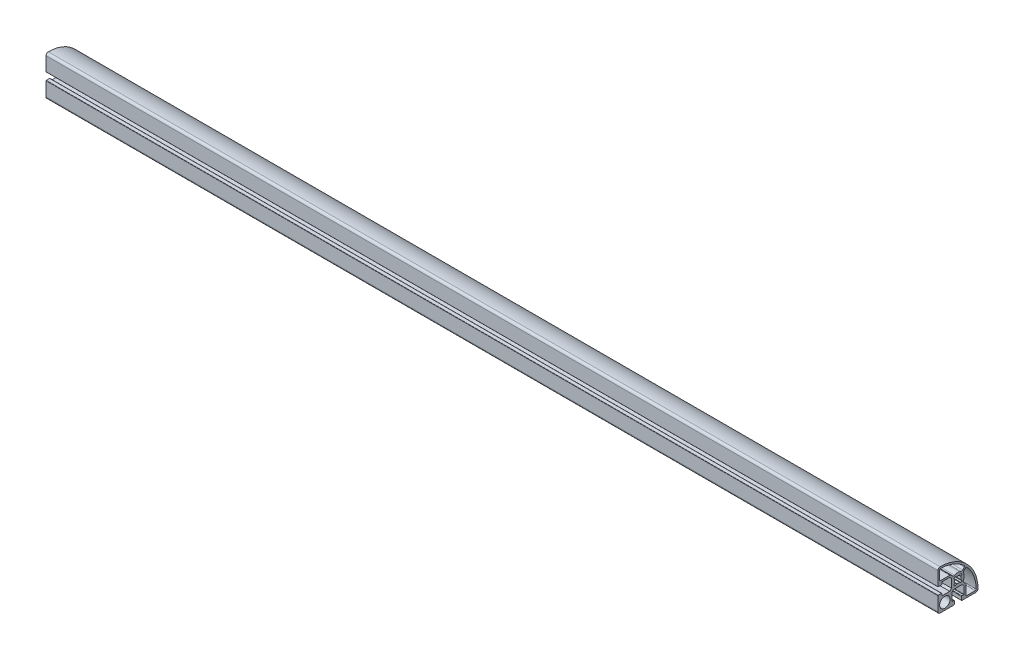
from build123d import *

# Parameters (mm, degrees)
MODEL9_R                          = 5.85
F_45_SARJA_1_0031_45_R_90_1_DEPTH = 1000


with BuildPart() as part:
    # Model9 → 45-sarja 1.0031 45 R 90_1 (new body)
    with BuildSketch(Plane(origin=(0, 0, 0), x_dir=(0, 0, -1), z_dir=(1, 0, 0))):
        with BuildLine():
            Line((4.799998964, -7.200000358), (6.799993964, -9.199997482))
            Line((6.799993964, -9.199997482), (6.799993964, -17.700000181))
            ThreePointArc((6.799993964, -17.700000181), (6.712127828, -17.912130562), (6.499998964, -18.000000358))
            Line((6.499998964, -18.000000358), (4.599998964, -18.000000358))
            ThreePointArc((4.599998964, -18.000000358), (4.246445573, -18.146446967), (4.099998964, -18.500000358))
            Line((4.099998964, -18.500000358), (4.099998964, -22.200000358))
            ThreePointArc((4.099998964, -22.200000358), (4.187865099, -22.412130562), (4.399993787, -22.500000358))
            Line((4.399993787, -22.500000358), (19.999993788, -22.500000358))
            ThreePointArc((19.999993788, -22.500000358), (21.767764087, -21.767769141), (22.499998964, -20.000000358))
            ThreePointArc((22.499998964, -20.000000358), (10.052037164, 10.052037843), (-20.000001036, 22.499999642))
            ThreePointArc((-20.000001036, 22.499999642), (-21.767767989, 21.767766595), (-22.500001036, 19.999999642))
            Line((-22.500001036, 19.999999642), (-22.500001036, 4.399999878))
            ThreePointArc((-22.500001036, 4.399999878), (-22.41213307, 4.187867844), (-22.200001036, 4.099999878))
            Line((-22.200001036, 4.099999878), (-18.500001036, 4.099999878))
            ThreePointArc((-18.500001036, 4.099999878), (-18.146447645, 4.246446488), (-18.000001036, 4.599999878))
            Line((-18.000001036, 4.599999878), (-18.000001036, 6.499999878))
            ThreePointArc((-18.000001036, 6.499999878), (-17.912130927, 6.712128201), (-17.700000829, 6.799994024))
            Line((-17.700000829, 6.799994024), (-9.199998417, 6.799994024))
            Line((-9.199998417, 6.799994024), (-7.200001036, 4.799999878))
            Line((-7.200001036, 4.799999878), (-7.200001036, -4.800000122))
            Line((-7.200001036, -4.800000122), (-9.200001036, -6.800000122))
            Line((-9.200001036, -6.800000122), (-17.700001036, -6.800000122))
            ThreePointArc((-17.700001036, -6.800000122), (-17.91213307, -6.712132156), (-18.000001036, -6.500000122))
            Line((-18.000001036, -6.500000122), (-18.000001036, -4.600000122))
            ThreePointArc((-18.000001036, -4.600000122), (-18.146447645, -4.246446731), (-18.500001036, -4.100000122))
            Line((-18.500001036, -4.100000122), (-22.200001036, -4.100000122))
            ThreePointArc((-22.200001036, -4.100000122), (-22.41213307, -4.187868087), (-22.500001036, -4.400000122))
            Line((-22.500001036, -4.400000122), (-22.500001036, -20.000000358))
            ThreePointArc((-22.500001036, -20.000000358), (-21.767767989, -21.767767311), (-20.000001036, -22.500000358))
            Line((-20.000001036, -22.500000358), (-4.400001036, -22.500000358))
            ThreePointArc((-4.400001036, -22.500000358), (-4.187869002, -22.412132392), (-4.100001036, -22.200000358))
            Line((-4.100001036, -22.200000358), (-4.100001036, -18.500000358))
            ThreePointArc((-4.100001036, -18.500000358), (-4.246447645, -18.146446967), (-4.600001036, -18.000000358))
            Line((-4.600001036, -18.000000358), (-6.500001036, -18.000000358))
            ThreePointArc((-6.500001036, -18.000000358), (-6.71213307, -17.912132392), (-6.800001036, -17.700000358))
            Line((-6.800001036, -17.700000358), (-6.800001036, -9.200000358))
            Line((-6.800001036, -9.200000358), (-4.800001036, -7.200000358))
            Line((-4.800001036, -7.200000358), (4.799998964, -7.200000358))
        make_face()
        with Locations((-14.650001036, -14.650000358)):
            Circle(MODEL9_R, mode=Mode.SUBTRACT)
        with BuildLine():
            Line((-20.500001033, 19.496834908), (-20.500001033, 9.799994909))
            ThreePointArc((-20.500001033, 9.799994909), (-20.207107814, 9.092888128), (-19.500001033, 8.799994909))
            Line((-19.500001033, 8.799994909), (-9.199998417, 8.799994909))
            ThreePointArc((-9.199998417, 8.799994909), (-8.434631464, 8.64775401), (-7.785784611, 8.214208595))
            Line((-7.785784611, 8.214208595), (-5.937878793, 6.366303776))
            ThreePointArc((-5.937878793, 6.366303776), (-4.781704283, 5.797233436), (-3.518406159, 6.051513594))
            ThreePointArc((-3.518406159, 6.051513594), (-0.283691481, 6.994248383), (3.016747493, 6.316582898))
            ThreePointArc((3.016747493, 6.316582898), (4.216879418, 6.150123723), (5.292888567, 6.707106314))
            Line((5.292888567, 6.707106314), (7.187782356, 8.601997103))
            ThreePointArc((7.187782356, 8.601997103), (7.480356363, 9.334428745), (7.151074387, 10.05110792))
            ThreePointArc((7.151074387, 10.05110792), (-5.214926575, 17.704794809), (-19.487342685, 20.496754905))
            ThreePointArc((-19.487342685, 20.496754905), (-20.202618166, 20.208403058), (-20.500001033, 19.496834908))
        make_face(mode=Mode.SUBTRACT)
        with BuildLine():
            Line((6.366302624, -5.937878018), (8.214207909, -7.785784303))
            ThreePointArc((8.214207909, -7.785784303), (8.647753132, -8.434630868), (8.799993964, -9.199997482))
            Line((8.799993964, -9.199997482), (8.799993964, -19.500000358))
            ThreePointArc((8.799993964, -19.500000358), (9.092887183, -20.207107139), (9.799993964, -20.500000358))
            Line((9.799993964, -20.500000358), (19.496834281, -20.500000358))
            ThreePointArc((19.496834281, -20.500000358), (20.208402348, -20.202617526), (20.496754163, -19.48734213))
            ThreePointArc((20.496754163, -19.48734213), (17.704794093, -5.214925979), (10.051107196, 7.151075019))
            ThreePointArc((10.051107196, 7.151075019), (9.334427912, 7.480357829), (8.601995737, 7.187783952))
            Line((8.601995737, 7.187783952), (6.707104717, 5.292889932))
            ThreePointArc((6.707104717, 5.292889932), (6.150122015, 4.216880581), (6.316581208, 3.016748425))
            ThreePointArc((6.316581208, 3.016748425), (6.994246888, -0.283691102), (6.051511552, -3.518406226))
            ThreePointArc((6.051511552, -3.518406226), (5.797232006, -4.781704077), (6.366302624, -5.937878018))
        make_face(mode=Mode.SUBTRACT)
        with BuildLine():
            Line((3.39410954, -4.384062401), (4.384059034, -3.394112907))
            ThreePointArc((4.384059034, -3.394112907), (4.471926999, -3.181980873), (4.384059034, -2.969848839))
            Line((4.384059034, -2.969848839), (3.363288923, -1.949078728))
            ThreePointArc((3.363288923, -1.949078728), (3.279574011, -1.786691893), (3.305577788, -1.605856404))
            ThreePointArc((3.305577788, -1.605856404), (3.674998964, -3.58e-07), (3.305577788, 1.605855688))
            ThreePointArc((3.305577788, 1.605855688), (3.279574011, 1.786691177), (3.363288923, 1.949078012))
            Line((3.363288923, 1.949078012), (4.384059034, 2.969848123))
            ThreePointArc((4.384059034, 2.969848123), (4.471926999, 3.181980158), (4.384059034, 3.394112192))
            Line((4.384059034, 3.394112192), (3.39410954, 4.384061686))
            ThreePointArc((3.39410954, 4.384061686), (3.181977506, 4.471929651), (2.969845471, 4.384061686))
            Line((2.969845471, 4.384061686), (1.949074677, 3.363290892))
            ThreePointArc((1.949074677, 3.363290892), (1.786687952, 3.279575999), (1.605852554, 3.305579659))
            ThreePointArc((1.605852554, 3.305579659), (-2.401e-06, 3.674999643), (-1.605857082, 3.305578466))
            ThreePointArc((-1.605857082, 3.305578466), (-1.786692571, 3.27957469), (-1.949079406, 3.363289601))
            Line((-1.949079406, 3.363289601), (-2.969851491, 4.384061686))
            ThreePointArc((-2.969851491, 4.384061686), (-3.181983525, 4.471929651), (-3.39411556, 4.384061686))
            Line((-3.39411556, 4.384061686), (-4.384065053, 3.394112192))
            ThreePointArc((-4.384065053, 3.394112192), (-4.471933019, 3.181980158), (-4.384065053, 2.969848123))
            Line((-4.384065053, 2.969848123), (-3.363292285, 1.949075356))
            ThreePointArc((-3.363292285, 1.949075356), (-3.279577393, 1.786688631), (-3.305581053, 1.605853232))
            ThreePointArc((-3.305581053, 1.605853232), (-3.675001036, -3.58e-07), (-3.305581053, -1.605853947))
            ThreePointArc((-3.305581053, -1.605853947), (-3.279577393, -1.786689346), (-3.363292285, -1.949076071))
            Line((-3.363292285, -1.949076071), (-4.384065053, -2.969848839))
            ThreePointArc((-4.384065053, -2.969848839), (-4.471933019, -3.181980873), (-4.384065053, -3.394112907))
            Line((-4.384065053, -3.394112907), (-3.394115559, -4.384062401))
            ThreePointArc((-3.394115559, -4.384062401), (-3.181983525, -4.471930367), (-2.969851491, -4.384062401))
            Line((-2.969851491, -4.384062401), (-1.949079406, -3.363290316))
            ThreePointArc((-1.949079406, -3.363290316), (-1.786692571, -3.279575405), (-1.605857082, -3.305579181))
            ThreePointArc((-1.605857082, -3.305579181), (-2.401e-06, -3.675000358), (1.605852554, -3.305580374))
            ThreePointArc((1.605852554, -3.305580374), (1.786687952, -3.279576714), (1.949074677, -3.363291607))
            Line((1.949074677, -3.363291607), (2.969845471, -4.384062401))
            ThreePointArc((2.969845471, -4.384062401), (3.181977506, -4.471930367), (3.39410954, -4.384062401))
        make_face(mode=Mode.SUBTRACT)
    extrude(amount=F_45_SARJA_1_0031_45_R_90_1_DEPTH)


solid = part.part
